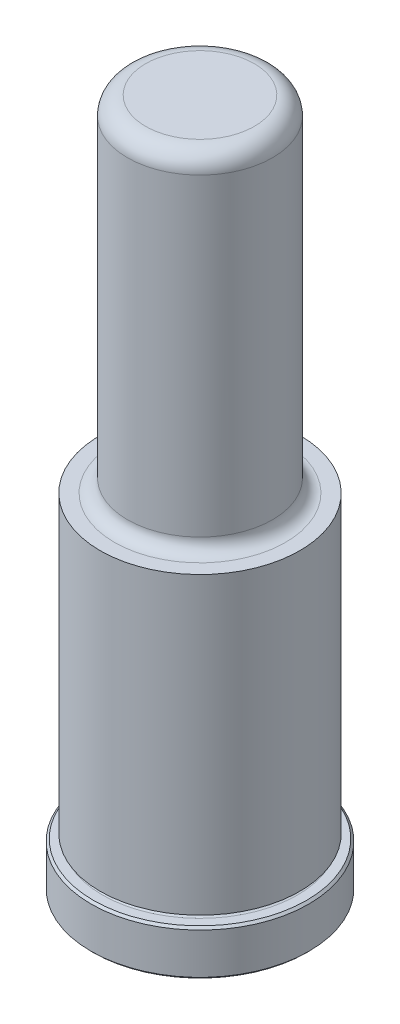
from build123d import *

# Parameters (mm, degrees)
CHAMFER1_SIZE = 0.381
FILLET7_R     = 3.175


with BuildPart() as part:
    # Sketch1 → Revolve1 (revolve)
    with BuildSketch(Plane(origin=(0, 0, 0), x_dir=(0, 0, -1), z_dir=(1, 0, 0)), mode=Mode.PRIVATE) as revolve1_sk:
        with BuildLine():
            Line((0, 0), (19.05, 0))
            Line((19.05, 0), (19.05, 7.9248))
            Line((19.05, 7.9248), (17.0688, 7.9248))
            ThreePointArc((17.0688, 7.9248), (16.6878, 8.3058), (17.0688, 8.6868))
            Line((17.0688, 8.6868), (17.4752, 8.6868))
            Line((17.4752, 8.6868), (17.4752, 60.325))
            Line((17.4752, 60.325), (14.9733, 60.325))
            ThreePointArc((14.9733, 60.325), (13.356853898, 60.994553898), (12.6873, 62.611))
            Line((12.6873, 62.611), (12.6873, 120.65))
            Line((12.6873, 120.65), (0, 120.65))
            Line((0, 120.65), (0, 0))
        make_face()
    revolve(revolve1_sk.sketch.rotate(Axis((0, 0, 0), (0, -1, 0)), 180), axis=Axis((0, 0, 0), (0, -1, 0)))

    # Chamfer1
    chamfer1_edges = [part.edges().sort_by_distance(p)[0] for p in [
        (0, 7.9248, -19.05),
        (0, 0, -19.05),
    ]]
    chamfer(chamfer1_edges, length=CHAMFER1_SIZE)

    # Fillet7
    fillet7_edges = [part.edges().sort_by_distance(p)[0] for p in [
        (0, 120.65, -12.6873),
    ]]
    fillet(fillet7_edges, radius=FILLET7_R)


solid = part.part
